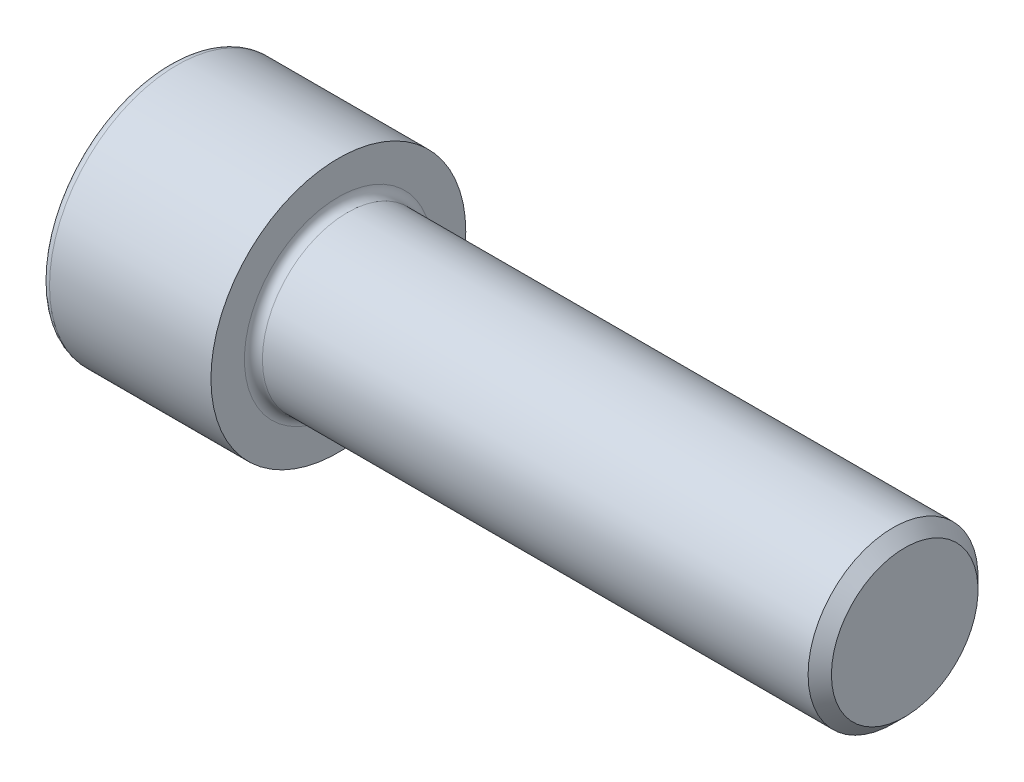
ISO-10303-21;
HEADER;
FILE_DESCRIPTION(('STEP AP214'),'2;1');
FILE_NAME('part.step','',(''),(''),'','','');
FILE_SCHEMA(('AUTOMOTIVE_DESIGN { 1 0 10303 214 1 1 1 1 }'));
ENDSEC;
DATA;
#1=APPLICATION_CONTEXT('core data for automotive mechanical design processes');
#2=APPLICATION_PROTOCOL_DEFINITION('international standard','automotive_design',2000,#1);
#3=PRODUCT_CONTEXT('',#1,'mechanical');
#4=PRODUCT('Part','Part','',(#3));
#5=PRODUCT_RELATED_PRODUCT_CATEGORY('part','',(#4));
#6=PRODUCT_DEFINITION_FORMATION('','',#4);
#7=PRODUCT_DEFINITION_CONTEXT('part definition',#1,'design');
#8=PRODUCT_DEFINITION('design','',#6,#7);
#9=PRODUCT_DEFINITION_SHAPE('','',#8);
#10=(LENGTH_UNIT() NAMED_UNIT(*) SI_UNIT(.MILLI.,.METRE.));
#11=(NAMED_UNIT(*) PLANE_ANGLE_UNIT() SI_UNIT($,.RADIAN.));
#12=(NAMED_UNIT(*) SI_UNIT($,.STERADIAN.) SOLID_ANGLE_UNIT());
#13=UNCERTAINTY_MEASURE_WITH_UNIT(LENGTH_MEASURE(1.E-05),#10,'distance_accuracy_value','');
#14=(GEOMETRIC_REPRESENTATION_CONTEXT(3) GLOBAL_UNCERTAINTY_ASSIGNED_CONTEXT((#13)) GLOBAL_UNIT_ASSIGNED_CONTEXT((#10,
#11,#12)) REPRESENTATION_CONTEXT('',''));
#15=CARTESIAN_POINT('',(0.,0.,0.));
#16=DIRECTION('',(0.,0.,1.));
#17=DIRECTION('',(1.,0.,0.));
#18=AXIS2_PLACEMENT_3D('',#15,#16,#17);
#19=CARTESIAN_POINT('',(0.,0.,0.));
#20=DIRECTION('',(-1.,0.,0.));
#21=DIRECTION('',(0.,0.,1.));
#22=AXIS2_PLACEMENT_3D('',#19,#20,#21);
#23=PLANE('',#22);
#24=DIRECTION('',(0.,-0.499999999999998,0.86602540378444));
#25=VECTOR('',#24,1.);
#26=CARTESIAN_POINT('',(0.,11.12842643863,0.));
#27=LINE('',#26,#25);
#28=CARTESIAN_POINT('',(0.,11.12842643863,0.));
#29=VERTEX_POINT('',#28);
#30=CARTESIAN_POINT('',(0.,5.56421321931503,9.63749999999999));
#31=VERTEX_POINT('',#30);
#32=EDGE_CURVE('E115',#29,#31,#27,.T.);
#33=ORIENTED_EDGE('',*,*,#32,.T.);
#34=DIRECTION('',(0.,1.,0.));
#35=VECTOR('',#34,1.);
#36=CARTESIAN_POINT('',(0.,-5.56421321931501,9.6375));
#37=LINE('',#36,#35);
#38=CARTESIAN_POINT('',(0.,-5.56421321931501,9.6375));
#39=VERTEX_POINT('',#38);
#40=EDGE_CURVE('E104',#39,#31,#37,.T.);
#41=ORIENTED_EDGE('',*,*,#40,.F.);
#42=DIRECTION('',(0.,-0.500000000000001,-0.866025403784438));
#43=VECTOR('',#42,1.);
#44=CARTESIAN_POINT('',(0.,-5.56421321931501,9.6375));
#45=LINE('',#44,#43);
#46=CARTESIAN_POINT('',(0.,-11.12842643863,0.));
#47=VERTEX_POINT('',#46);
#48=EDGE_CURVE('E114',#39,#47,#45,.T.);
#49=ORIENTED_EDGE('',*,*,#48,.T.);
#50=DIRECTION('',(0.,0.499999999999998,-0.86602540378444));
#51=VECTOR('',#50,1.);
#52=CARTESIAN_POINT('',(0.,-11.12842643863,0.));
#53=LINE('',#52,#51);
#54=CARTESIAN_POINT('',(0.,-5.56421321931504,-9.6375));
#55=VERTEX_POINT('',#54);
#56=EDGE_CURVE('E133',#47,#55,#53,.T.);
#57=ORIENTED_EDGE('',*,*,#56,.T.);
#58=DIRECTION('',(0.,-1.,0.));
#59=VECTOR('',#58,1.);
#60=CARTESIAN_POINT('',(0.,5.564213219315,-9.63750000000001));
#61=LINE('',#60,#59);
#62=CARTESIAN_POINT('',(0.,5.564213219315,-9.63750000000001));
#63=VERTEX_POINT('',#62);
#64=EDGE_CURVE('E136',#63,#55,#61,.T.);
#65=ORIENTED_EDGE('',*,*,#64,.F.);
#66=DIRECTION('',(0.,-0.500000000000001,-0.866025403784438));
#67=VECTOR('',#66,1.);
#68=CARTESIAN_POINT('',(0.,11.12842643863,0.));
#69=LINE('',#68,#67);
#70=EDGE_CURVE('E129',#29,#63,#69,.T.);
#71=ORIENTED_EDGE('',*,*,#70,.F.);
#72=EDGE_LOOP('',(#33,#41,#49,#57,#65,#71));
#73=FACE_BOUND('',#72,.T.);
#74=CARTESIAN_POINT('',(0.,0.,0.));
#75=DIRECTION('',(-1.,0.,0.));
#76=DIRECTION('',(0.,0.,1.));
#77=AXIS2_PLACEMENT_3D('',#74,#75,#76);
#78=CIRCLE('',#77,16.8);
#79=CARTESIAN_POINT('',(0.,0.,16.8));
#80=VERTEX_POINT('',#79);
#81=EDGE_CURVE('E40',#80,#80,#78,.T.);
#82=ORIENTED_EDGE('',*,*,#81,.T.);
#83=EDGE_LOOP('',(#82));
#84=FACE_BOUND('',#83,.T.);
#85=ADVANCED_FACE('F33',(#73,#84),#23,.T.);
#86=CARTESIAN_POINT('',(-31.75,0.,0.));
#87=DIRECTION('',(-1.,0.,0.));
#88=DIRECTION('',(0.,0.,1.));
#89=AXIS2_PLACEMENT_3D('',#86,#87,#88);
#90=CYLINDRICAL_SURFACE('',#89,18.);
#91=CARTESIAN_POINT('',(1.2,0.,0.));
#92=DIRECTION('',(-1.,0.,0.));
#93=DIRECTION('',(0.,0.,1.));
#94=AXIS2_PLACEMENT_3D('',#91,#92,#93);
#95=CIRCLE('',#94,18.);
#96=CARTESIAN_POINT('',(1.2,0.,18.));
#97=VERTEX_POINT('',#96);
#98=EDGE_CURVE('E11',#97,#97,#95,.F.);
#99=ORIENTED_EDGE('',*,*,#98,.T.);
#100=EDGE_LOOP('',(#99));
#101=FACE_BOUND('',#100,.T.);
#102=CARTESIAN_POINT('',(24.,0.,0.));
#103=DIRECTION('',(-1.,0.,0.));
#104=DIRECTION('',(0.,0.,1.));
#105=AXIS2_PLACEMENT_3D('',#102,#103,#104);
#106=CIRCLE('',#105,18.);
#107=CARTESIAN_POINT('',(24.,0.,18.));
#108=VERTEX_POINT('',#107);
#109=EDGE_CURVE('E181',#108,#108,#106,.T.);
#110=ORIENTED_EDGE('',*,*,#109,.T.);
#111=EDGE_LOOP('',(#110));
#112=FACE_BOUND('',#111,.T.);
#113=ADVANCED_FACE('F208',(#101,#112),#90,.T.);
#114=CARTESIAN_POINT('',(24.,18.,0.));
#115=DIRECTION('',(1.,0.,0.));
#116=DIRECTION('',(0.,0.,-1.));
#117=AXIS2_PLACEMENT_3D('',#114,#115,#116);
#118=PLANE('',#117);
#119=CARTESIAN_POINT('',(24.,0.,0.));
#120=DIRECTION('',(1.,0.,0.));
#121=DIRECTION('',(0.,0.,-1.));
#122=AXIS2_PLACEMENT_3D('',#119,#120,#121);
#123=CIRCLE('',#122,13.27);
#124=CARTESIAN_POINT('',(24.,0.,-13.27));
#125=VERTEX_POINT('',#124);
#126=EDGE_CURVE('E184',#125,#125,#123,.F.);
#127=ORIENTED_EDGE('',*,*,#126,.T.);
#128=EDGE_LOOP('',(#127));
#129=FACE_BOUND('',#128,.T.);
#130=ORIENTED_EDGE('',*,*,#109,.F.);
#131=EDGE_LOOP('',(#130));
#132=FACE_BOUND('',#131,.T.);
#133=ADVANCED_FACE('F212',(#129,#132),#118,.T.);
#134=CARTESIAN_POINT('',(-31.75,0.,0.));
#135=DIRECTION('',(-1.,0.,0.));
#136=DIRECTION('',(0.,0.,1.));
#137=AXIS2_PLACEMENT_3D('',#134,#135,#136);
#138=CYLINDRICAL_SURFACE('',#137,12.);
#139=CARTESIAN_POINT('',(25.27,0.,0.));
#140=DIRECTION('',(1.,0.,0.));
#141=DIRECTION('',(0.,0.,-1.));
#142=AXIS2_PLACEMENT_3D('',#139,#140,#141);
#143=CIRCLE('',#142,12.);
#144=CARTESIAN_POINT('',(25.27,0.,-12.));
#145=VERTEX_POINT('',#144);
#146=EDGE_CURVE('E187',#145,#145,#143,.T.);
#147=ORIENTED_EDGE('',*,*,#146,.T.);
#148=EDGE_LOOP('',(#147));
#149=FACE_BOUND('',#148,.T.);
#150=CARTESIAN_POINT('',(102.352,0.,0.));
#151=DIRECTION('',(-1.,0.,0.));
#152=DIRECTION('',(0.,0.,1.));
#153=AXIS2_PLACEMENT_3D('',#150,#151,#152);
#154=CIRCLE('',#153,12.);
#155=CARTESIAN_POINT('',(102.352,0.,12.));
#156=VERTEX_POINT('',#155);
#157=EDGE_CURVE('E178',#156,#156,#154,.T.);
#158=ORIENTED_EDGE('',*,*,#157,.T.);
#159=EDGE_LOOP('',(#158));
#160=FACE_BOUND('',#159,.T.);
#161=ADVANCED_FACE('F217',(#149,#160),#138,.T.);
#162=CARTESIAN_POINT('',(104.,0.,0.));
#163=DIRECTION('',(-1.,0.,0.));
#164=DIRECTION('',(0.,0.,1.));
#165=AXIS2_PLACEMENT_3D('',#162,#163,#164);
#166=CONICAL_SURFACE('',#165,10.352,0.78539816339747);
#167=ORIENTED_EDGE('',*,*,#157,.F.);
#168=EDGE_LOOP('',(#167));
#169=FACE_BOUND('',#168,.T.);
#170=CARTESIAN_POINT('',(104.,0.,0.));
#171=DIRECTION('',(-1.,0.,0.));
#172=DIRECTION('',(0.,0.,1.));
#173=AXIS2_PLACEMENT_3D('',#170,#171,#172);
#174=CIRCLE('',#173,10.352);
#175=CARTESIAN_POINT('',(104.,0.,10.352));
#176=VERTEX_POINT('',#175);
#177=EDGE_CURVE('E174',#176,#176,#174,.T.);
#178=ORIENTED_EDGE('',*,*,#177,.T.);
#179=EDGE_LOOP('',(#178));
#180=FACE_BOUND('',#179,.T.);
#181=ADVANCED_FACE('F224',(#169,#180),#166,.T.);
#182=CARTESIAN_POINT('',(104.,10.352,0.));
#183=DIRECTION('',(1.,0.,0.));
#184=DIRECTION('',(0.,0.,-1.));
#185=AXIS2_PLACEMENT_3D('',#182,#183,#184);
#186=PLANE('',#185);
#187=ORIENTED_EDGE('',*,*,#177,.F.);
#188=EDGE_LOOP('',(#187));
#189=FACE_BOUND('',#188,.T.);
#190=ADVANCED_FACE('F202',(#189),#186,.T.);
#191=CARTESIAN_POINT('',(25.27,0.,0.));
#192=DIRECTION('',(1.,0.,0.));
#193=DIRECTION('',(0.,0.,-1.));
#194=AXIS2_PLACEMENT_3D('',#191,#192,#193);
#195=TOROIDAL_SURFACE('',#194,13.27,1.27);
#196=ORIENTED_EDGE('',*,*,#146,.F.);
#197=EDGE_LOOP('',(#196));
#198=FACE_BOUND('',#197,.T.);
#199=ORIENTED_EDGE('',*,*,#126,.F.);
#200=EDGE_LOOP('',(#199));
#201=FACE_BOUND('',#200,.T.);
#202=ADVANCED_FACE('F194',(#198,#201),#195,.F.);
#203=CARTESIAN_POINT('',(1.2,0.,0.));
#204=DIRECTION('',(-1.,0.,0.));
#205=DIRECTION('',(0.,0.,1.));
#206=AXIS2_PLACEMENT_3D('',#203,#204,#205);
#207=TOROIDAL_SURFACE('',#206,16.8,1.2);
#208=ORIENTED_EDGE('',*,*,#98,.F.);
#209=EDGE_LOOP('',(#208));
#210=FACE_BOUND('',#209,.T.);
#211=ORIENTED_EDGE('',*,*,#81,.F.);
#212=EDGE_LOOP('',(#211));
#213=FACE_BOUND('',#212,.T.);
#214=ADVANCED_FACE('F192',(#210,#213),#207,.T.);
#215=CARTESIAN_POINT('',(12.573,11.12842643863,0.));
#216=DIRECTION('',(0.,-0.86602540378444,-0.499999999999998));
#217=DIRECTION('',(0.,0.499999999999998,-0.866025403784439));
#218=AXIS2_PLACEMENT_3D('',#215,#216,#217);
#219=PLANE('',#218);
#220=ORIENTED_EDGE('',*,*,#32,.F.);
#221=DIRECTION('',(-1.,0.,0.));
#222=VECTOR('',#221,1.);
#223=CARTESIAN_POINT('',(12.573,11.12842643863,0.));
#224=LINE('',#223,#222);
#225=CARTESIAN_POINT('',(12.573,11.12842643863,0.));
#226=VERTEX_POINT('',#225);
#227=EDGE_CURVE('E159',#226,#29,#224,.T.);
#228=ORIENTED_EDGE('',*,*,#227,.F.);
#229=DIRECTION('',(0.,-0.499999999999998,0.86602540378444));
#230=VECTOR('',#229,1.);
#231=CARTESIAN_POINT('',(12.573,11.12842643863,0.));
#232=LINE('',#231,#230);
#233=CARTESIAN_POINT('',(12.573,8.34631982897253,4.81874999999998));
#234=VERTEX_POINT('',#233);
#235=EDGE_CURVE('E139',#226,#234,#232,.T.);
#236=ORIENTED_EDGE('',*,*,#235,.T.);
#237=CARTESIAN_POINT('',(12.573,5.56421321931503,9.63749999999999));
#238=VERTEX_POINT('',#237);
#239=EDGE_CURVE('E123',#234,#238,#232,.T.);
#240=ORIENTED_EDGE('',*,*,#239,.T.);
#241=DIRECTION('',(-1.,0.,0.));
#242=VECTOR('',#241,1.);
#243=CARTESIAN_POINT('',(12.573,5.56421321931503,9.63749999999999));
#244=LINE('',#243,#242);
#245=EDGE_CURVE('E108',#238,#31,#244,.T.);
#246=ORIENTED_EDGE('',*,*,#245,.T.);
#247=EDGE_LOOP('',(#220,#228,#236,#240,#246));
#248=FACE_BOUND('',#247,.T.);
#249=ADVANCED_FACE('F119',(#248),#219,.T.);
#250=CARTESIAN_POINT('',(12.573,-5.56421321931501,9.6375));
#251=DIRECTION('',(0.,0.,1.));
#252=DIRECTION('',(0.,-1.,0.));
#253=AXIS2_PLACEMENT_3D('',#250,#251,#252);
#254=PLANE('',#253);
#255=ORIENTED_EDGE('',*,*,#40,.T.);
#256=ORIENTED_EDGE('',*,*,#245,.F.);
#257=DIRECTION('',(0.,1.,0.));
#258=VECTOR('',#257,1.);
#259=CARTESIAN_POINT('',(12.573,-5.56421321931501,9.6375));
#260=LINE('',#259,#258);
#261=CARTESIAN_POINT('',(12.573,0.,9.6375));
#262=VERTEX_POINT('',#261);
#263=EDGE_CURVE('E141',#262,#238,#260,.T.);
#264=ORIENTED_EDGE('',*,*,#263,.F.);
#265=CARTESIAN_POINT('',(12.573,-5.56421321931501,9.6375));
#266=VERTEX_POINT('',#265);
#267=EDGE_CURVE('E142',#266,#262,#260,.T.);
#268=ORIENTED_EDGE('',*,*,#267,.F.);
#269=DIRECTION('',(-1.,0.,0.));
#270=VECTOR('',#269,1.);
#271=CARTESIAN_POINT('',(12.573,-5.56421321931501,9.6375));
#272=LINE('',#271,#270);
#273=EDGE_CURVE('E110',#266,#39,#272,.T.);
#274=ORIENTED_EDGE('',*,*,#273,.T.);
#275=EDGE_LOOP('',(#255,#256,#264,#268,#274));
#276=FACE_BOUND('',#275,.T.);
#277=ADVANCED_FACE('F106',(#276),#254,.F.);
#278=CARTESIAN_POINT('',(12.573,-5.56421321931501,9.6375));
#279=DIRECTION('',(0.,0.866025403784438,-0.500000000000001));
#280=DIRECTION('',(0.,0.500000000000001,0.866025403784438));
#281=AXIS2_PLACEMENT_3D('',#278,#279,#280);
#282=PLANE('',#281);
#283=ORIENTED_EDGE('',*,*,#48,.F.);
#284=ORIENTED_EDGE('',*,*,#273,.F.);
#285=DIRECTION('',(0.,-0.500000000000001,-0.866025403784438));
#286=VECTOR('',#285,1.);
#287=CARTESIAN_POINT('',(12.573,-5.56421321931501,9.6375));
#288=LINE('',#287,#286);
#289=CARTESIAN_POINT('',(12.573,-8.34631982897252,4.81875000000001));
#290=VERTEX_POINT('',#289);
#291=EDGE_CURVE('E146',#266,#290,#288,.T.);
#292=ORIENTED_EDGE('',*,*,#291,.T.);
#293=CARTESIAN_POINT('',(12.573,-11.12842643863,0.));
#294=VERTEX_POINT('',#293);
#295=EDGE_CURVE('E145',#290,#294,#288,.T.);
#296=ORIENTED_EDGE('',*,*,#295,.T.);
#297=DIRECTION('',(-1.,0.,0.));
#298=VECTOR('',#297,1.);
#299=CARTESIAN_POINT('',(12.573,-11.12842643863,0.));
#300=LINE('',#299,#298);
#301=EDGE_CURVE('E167',#294,#47,#300,.T.);
#302=ORIENTED_EDGE('',*,*,#301,.T.);
#303=EDGE_LOOP('',(#283,#284,#292,#296,#302));
#304=FACE_BOUND('',#303,.T.);
#305=ADVANCED_FACE('F274',(#304),#282,.T.);
#306=CARTESIAN_POINT('',(12.573,-11.12842643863,0.));
#307=DIRECTION('',(0.,0.86602540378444,0.499999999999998));
#308=DIRECTION('',(0.,-0.499999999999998,0.86602540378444));
#309=AXIS2_PLACEMENT_3D('',#306,#307,#308);
#310=PLANE('',#309);
#311=ORIENTED_EDGE('',*,*,#56,.F.);
#312=ORIENTED_EDGE('',*,*,#301,.F.);
#313=DIRECTION('',(0.,0.499999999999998,-0.86602540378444));
#314=VECTOR('',#313,1.);
#315=CARTESIAN_POINT('',(12.573,-11.12842643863,0.));
#316=LINE('',#315,#314);
#317=CARTESIAN_POINT('',(12.573,-8.34631982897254,-4.81874999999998));
#318=VERTEX_POINT('',#317);
#319=EDGE_CURVE('E150',#294,#318,#316,.T.);
#320=ORIENTED_EDGE('',*,*,#319,.T.);
#321=CARTESIAN_POINT('',(12.573,-5.56421321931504,-9.6375));
#322=VERTEX_POINT('',#321);
#323=EDGE_CURVE('E149',#318,#322,#316,.T.);
#324=ORIENTED_EDGE('',*,*,#323,.T.);
#325=DIRECTION('',(-1.,0.,0.));
#326=VECTOR('',#325,1.);
#327=CARTESIAN_POINT('',(12.573,-5.56421321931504,-9.6375));
#328=LINE('',#327,#326);
#329=EDGE_CURVE('E164',#322,#55,#328,.T.);
#330=ORIENTED_EDGE('',*,*,#329,.T.);
#331=EDGE_LOOP('',(#311,#312,#320,#324,#330));
#332=FACE_BOUND('',#331,.T.);
#333=ADVANCED_FACE('F283',(#332),#310,.T.);
#334=CARTESIAN_POINT('',(12.573,5.564213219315,-9.63750000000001));
#335=DIRECTION('',(0.,0.,-1.));
#336=DIRECTION('',(0.,1.,0.));
#337=AXIS2_PLACEMENT_3D('',#334,#335,#336);
#338=PLANE('',#337);
#339=ORIENTED_EDGE('',*,*,#64,.T.);
#340=ORIENTED_EDGE('',*,*,#329,.F.);
#341=DIRECTION('',(0.,-1.,0.));
#342=VECTOR('',#341,1.);
#343=CARTESIAN_POINT('',(12.573,5.564213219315,-9.63750000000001));
#344=LINE('',#343,#342);
#345=CARTESIAN_POINT('',(12.573,0.,-9.6375));
#346=VERTEX_POINT('',#345);
#347=EDGE_CURVE('E153',#346,#322,#344,.T.);
#348=ORIENTED_EDGE('',*,*,#347,.F.);
#349=CARTESIAN_POINT('',(12.573,5.564213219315,-9.63750000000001));
#350=VERTEX_POINT('',#349);
#351=EDGE_CURVE('E47',#350,#346,#344,.T.);
#352=ORIENTED_EDGE('',*,*,#351,.F.);
#353=DIRECTION('',(-1.,0.,0.));
#354=VECTOR('',#353,1.);
#355=CARTESIAN_POINT('',(12.573,5.564213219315,-9.63750000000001));
#356=LINE('',#355,#354);
#357=EDGE_CURVE('E161',#350,#63,#356,.T.);
#358=ORIENTED_EDGE('',*,*,#357,.T.);
#359=EDGE_LOOP('',(#339,#340,#348,#352,#358));
#360=FACE_BOUND('',#359,.T.);
#361=ADVANCED_FACE('F293',(#360),#338,.F.);
#362=CARTESIAN_POINT('',(12.573,11.12842643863,0.));
#363=DIRECTION('',(0.,0.866025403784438,-0.500000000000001));
#364=DIRECTION('',(0.,0.500000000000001,0.866025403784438));
#365=AXIS2_PLACEMENT_3D('',#362,#363,#364);
#366=PLANE('',#365);
#367=ORIENTED_EDGE('',*,*,#70,.T.);
#368=ORIENTED_EDGE('',*,*,#357,.F.);
#369=DIRECTION('',(0.,-0.500000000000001,-0.866025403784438));
#370=VECTOR('',#369,1.);
#371=CARTESIAN_POINT('',(12.573,11.12842643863,0.));
#372=LINE('',#371,#370);
#373=CARTESIAN_POINT('',(12.573,8.34631982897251,-4.81875000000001));
#374=VERTEX_POINT('',#373);
#375=EDGE_CURVE('E155',#374,#350,#372,.T.);
#376=ORIENTED_EDGE('',*,*,#375,.F.);
#377=EDGE_CURVE('E156',#226,#374,#372,.T.);
#378=ORIENTED_EDGE('',*,*,#377,.F.);
#379=ORIENTED_EDGE('',*,*,#227,.T.);
#380=EDGE_LOOP('',(#367,#368,#376,#378,#379));
#381=FACE_BOUND('',#380,.T.);
#382=ADVANCED_FACE('F303',(#381),#366,.F.);
#383=CARTESIAN_POINT('',(12.573,16.692639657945,-9.63750000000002));
#384=DIRECTION('',(1.,0.,0.));
#385=DIRECTION('',(0.,0.,-1.));
#386=AXIS2_PLACEMENT_3D('',#383,#384,#385);
#387=PLANE('',#386);
#388=ORIENTED_EDGE('',*,*,#347,.T.);
#389=ORIENTED_EDGE('',*,*,#323,.F.);
#390=CARTESIAN_POINT('',(12.573,0.,0.));
#391=DIRECTION('',(-1.,0.,0.));
#392=DIRECTION('',(0.,0.,1.));
#393=AXIS2_PLACEMENT_3D('',#390,#391,#392);
#394=CIRCLE('',#393,9.6375);
#395=EDGE_CURVE('E389',#346,#318,#394,.T.);
#396=ORIENTED_EDGE('',*,*,#395,.F.);
#397=EDGE_LOOP('',(#388,#389,#396));
#398=FACE_BOUND('',#397,.T.);
#399=ADVANCED_FACE('F313',(#398),#387,.F.);
#400=ORIENTED_EDGE('',*,*,#319,.F.);
#401=ORIENTED_EDGE('',*,*,#295,.F.);
#402=EDGE_CURVE('E387',#318,#290,#394,.T.);
#403=ORIENTED_EDGE('',*,*,#402,.F.);
#404=EDGE_LOOP('',(#400,#401,#403));
#405=FACE_BOUND('',#404,.T.);
#406=ADVANCED_FACE('F323',(#405),#387,.F.);
#407=ORIENTED_EDGE('',*,*,#291,.F.);
#408=ORIENTED_EDGE('',*,*,#267,.T.);
#409=EDGE_CURVE('E124',#290,#262,#394,.T.);
#410=ORIENTED_EDGE('',*,*,#409,.F.);
#411=EDGE_LOOP('',(#407,#408,#410));
#412=FACE_BOUND('',#411,.T.);
#413=ADVANCED_FACE('F334',(#412),#387,.F.);
#414=ORIENTED_EDGE('',*,*,#263,.T.);
#415=ORIENTED_EDGE('',*,*,#239,.F.);
#416=EDGE_CURVE('E171',#262,#234,#394,.T.);
#417=ORIENTED_EDGE('',*,*,#416,.F.);
#418=EDGE_LOOP('',(#414,#415,#417));
#419=FACE_BOUND('',#418,.T.);
#420=ADVANCED_FACE('F343',(#419),#387,.F.);
#421=ORIENTED_EDGE('',*,*,#235,.F.);
#422=ORIENTED_EDGE('',*,*,#377,.T.);
#423=EDGE_CURVE('E175',#234,#374,#394,.T.);
#424=ORIENTED_EDGE('',*,*,#423,.F.);
#425=EDGE_LOOP('',(#421,#422,#424));
#426=FACE_BOUND('',#425,.T.);
#427=ADVANCED_FACE('F352',(#426),#387,.F.);
#428=ORIENTED_EDGE('',*,*,#375,.T.);
#429=ORIENTED_EDGE('',*,*,#351,.T.);
#430=EDGE_CURVE('E392',#374,#346,#394,.T.);
#431=ORIENTED_EDGE('',*,*,#430,.F.);
#432=EDGE_LOOP('',(#428,#429,#431));
#433=FACE_BOUND('',#432,.T.);
#434=ADVANCED_FACE('F326',(#433),#387,.F.);
#435=CARTESIAN_POINT('',(12.573,0.,0.));
#436=DIRECTION('',(-1.,0.,0.));
#437=DIRECTION('',(0.,0.,1.));
#438=AXIS2_PLACEMENT_3D('',#435,#436,#437);
#439=CONICAL_SURFACE('',#438,9.6375,1.04719755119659);
#440=CARTESIAN_POINT('',(18.1372132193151,0.,0.));
#441=VERTEX_POINT('',#440);
#442=VERTEX_LOOP('',#441);
#443=FACE_BOUND('',#442,.T.);
#444=ORIENTED_EDGE('',*,*,#416,.T.);
#445=ORIENTED_EDGE('',*,*,#423,.T.);
#446=ORIENTED_EDGE('',*,*,#430,.T.);
#447=ORIENTED_EDGE('',*,*,#395,.T.);
#448=ORIENTED_EDGE('',*,*,#402,.T.);
#449=ORIENTED_EDGE('',*,*,#409,.T.);
#450=EDGE_LOOP('',(#444,#445,#446,#447,#448,#449));
#451=FACE_BOUND('',#450,.T.);
#452=ADVANCED_FACE('F369',(#443,#451),#439,.F.);
#453=CLOSED_SHELL('',(#85,#113,#133,#161,#181,#190,#202,#214,#249,#277,#305,#333,#361,#382,#399,
#406,#413,#420,#427,#434,#452));
#454=MANIFOLD_SOLID_BREP('B2',#453);
#455=ADVANCED_BREP_SHAPE_REPRESENTATION('',(#18,#454),#14);
#456=SHAPE_DEFINITION_REPRESENTATION(#9,#455);
ENDSEC;
END-ISO-10303-21;
